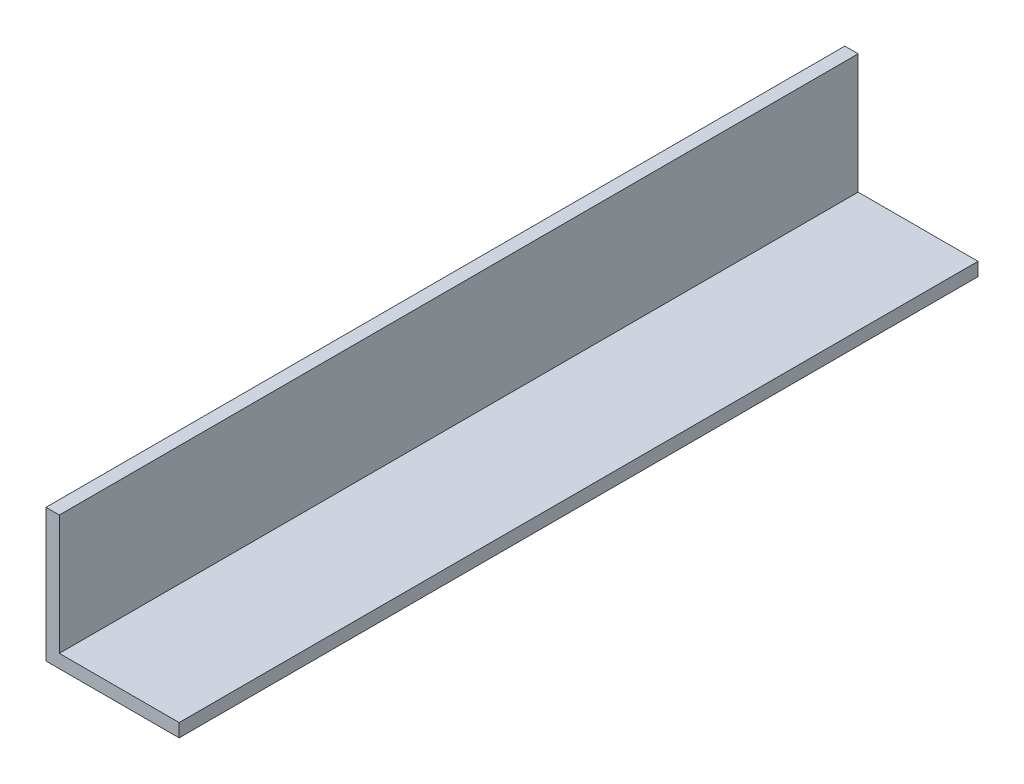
from build123d import *

# Parameters (mm, degrees)
EXTRUDE_1_DEPTH = 150


with BuildPart() as part:
    # Sketch 1 → Extrude 1 (new, symmetric)
    with BuildSketch(Plane.XY):
        Polygon((0, 0), (0, 45), (-5, 45), (-5, -5), (45, -5), (45, 0), align=None)
    extrude(amount=EXTRUDE_1_DEPTH, both=True)


solid = part.part
